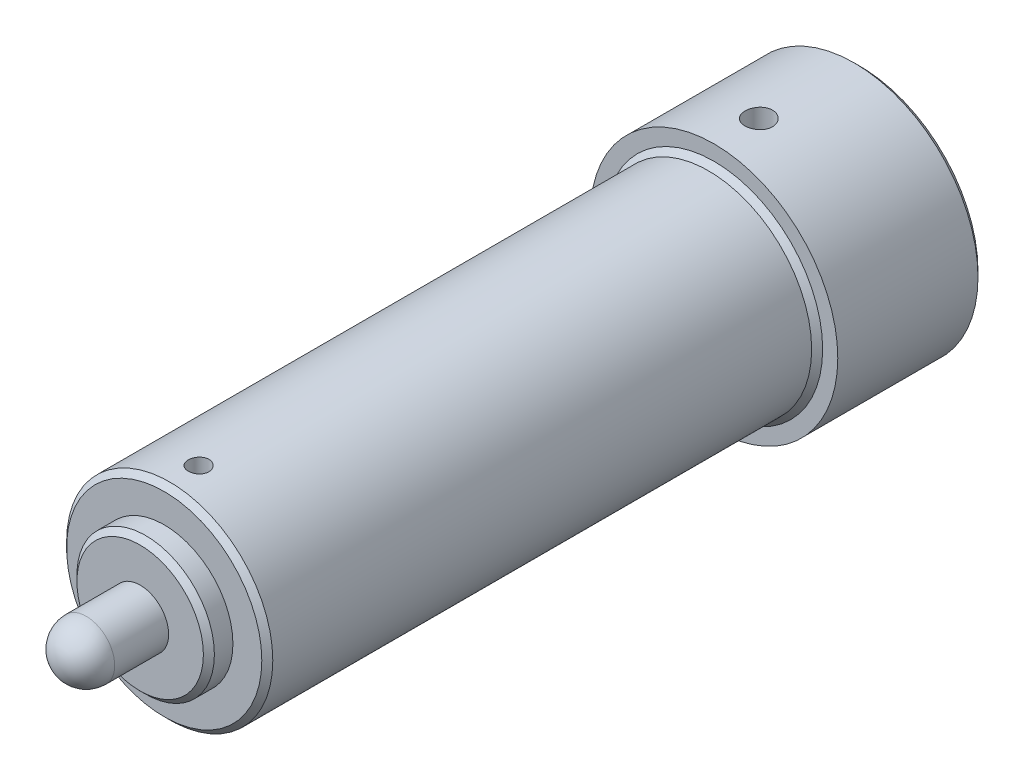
from build123d import *

# Parameters (mm, degrees)
SKETCH1_R               = 18
BOSS_EXTRUDE1_DEPTH     = 21.2
SKETCH2_R               = 15
BOSS_EXTRUDE2_DEPTH     = 80
SKETCH3_R               = 10
BOSS_EXTRUDE3_DEPTH     = 3.5
SKETCH4_R               = 4.15
BOSS_EXTRUDE4_DEPTH     = 12
FILLET1_R               = 4.15
CHAMFER1_SIZE           = 0.8
CUT_EXTRUDE1_DEPTH      = 120.444087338
CUT_EXTRUDE1_DEPTH_BACK = 120.444087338
SKETCH5_R               = 2
SKETCH5_R_2             = 1.5
CUT_EXTRUDE2_DEPTH      = 120.444087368
CUT_EXTRUDE2_DEPTH_BACK = 4
SKETCH6_R               = 15.5


with BuildPart() as part:
    # Sketch1 → Boss-Extrude1 (new body)
    with BuildSketch(Plane.XY):
        Circle(SKETCH1_R)
    extrude(amount=BOSS_EXTRUDE1_DEPTH)

    # Sketch2 → Boss-Extrude2 (add)
    with BuildSketch(Plane.XY.offset(21.2)):
        Circle(SKETCH2_R)
    extrude(amount=BOSS_EXTRUDE2_DEPTH)

    # Sketch3 → Boss-Extrude3 (add)
    with BuildSketch(Plane.XY.offset(101.2)):
        Circle(SKETCH3_R)
    extrude(amount=BOSS_EXTRUDE3_DEPTH)

    # Sketch4 → Boss-Extrude4 (add)
    with BuildSketch(Plane.XY.offset(104.7)):
        Circle(SKETCH4_R)
    extrude(amount=BOSS_EXTRUDE4_DEPTH)

    # Fillet1
    fillet1_edges = [part.edges().sort_by_distance(p)[0] for p in [
        (-4.15, 0, 116.7),
    ]]
    fillet(fillet1_edges, radius=FILLET1_R)

    # Chamfer1
    chamfer1_edges = [part.edges().sort_by_distance(p)[0] for p in [
        (-10, 0, 104.7),
        (-18, 0, 0),
        (-15, 0, 21.2),
        (-15, 0, 101.2),
    ]]
    chamfer(chamfer1_edges, length=CHAMFER1_SIZE)

    # Sketch5 → Cut-Extrude1 (cut, two sides: drawn at the far end of the back side and taken through both)
    with BuildSketch(Plane(origin=(0, 0, 0), x_dir=(1, 0, 0), z_dir=(0, 1, 0)).offset(-CUT_EXTRUDE1_DEPTH_BACK)):
        with Locations(Location((0, -14.7, 0), (0, 0, 270))):
            Circle(SKETCH5_R)
        with Locations(Location((0, -96.2, 0), (0, 0, 270))):
            Circle(SKETCH5_R_2)
    extrude(amount=CUT_EXTRUDE1_DEPTH + CUT_EXTRUDE1_DEPTH_BACK, mode=Mode.SUBTRACT)

    # Sketch6 → Cut-Extrude2 (cut, two sides: drawn at the far end of the back side and taken through both)
    with BuildSketch(Plane(origin=(0, 0, 0), x_dir=(-1, 0, 0), z_dir=(0, 0, -1)).offset(-CUT_EXTRUDE2_DEPTH_BACK)):
        with Locations(Location((0, 0, 0), (0, 0, 180))):
            Circle(SKETCH6_R)
    extrude(amount=CUT_EXTRUDE2_DEPTH + CUT_EXTRUDE2_DEPTH_BACK, mode=Mode.SUBTRACT)


solid = part.part
